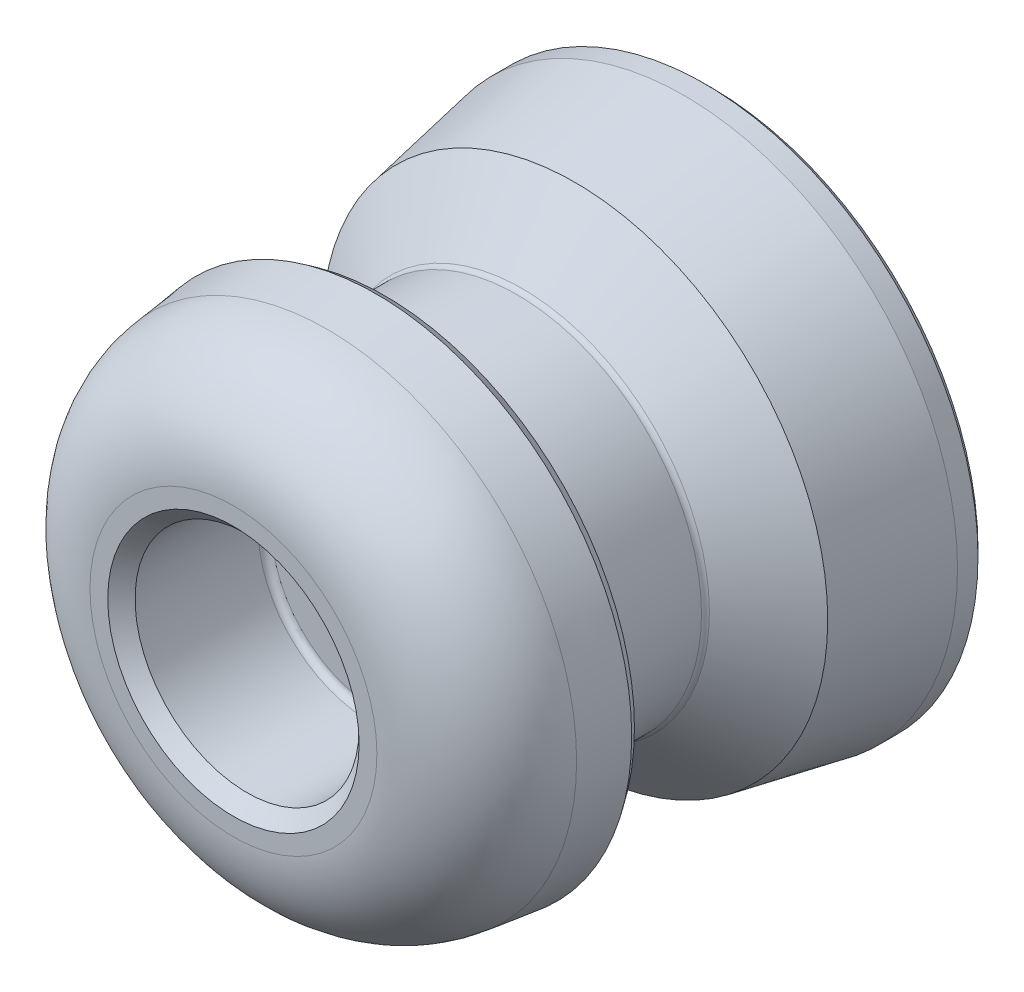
ISO-10303-21;
HEADER;
FILE_DESCRIPTION(('STEP AP214'),'2;1');
FILE_NAME('part.step','',(''),(''),'','','');
FILE_SCHEMA(('AUTOMOTIVE_DESIGN { 1 0 10303 214 1 1 1 1 }'));
ENDSEC;
DATA;
#1=APPLICATION_CONTEXT('core data for automotive mechanical design processes');
#2=APPLICATION_PROTOCOL_DEFINITION('international standard','automotive_design',2000,#1);
#3=PRODUCT_CONTEXT('',#1,'mechanical');
#4=PRODUCT('Part','Part','',(#3));
#5=PRODUCT_RELATED_PRODUCT_CATEGORY('part','',(#4));
#6=PRODUCT_DEFINITION_FORMATION('','',#4);
#7=PRODUCT_DEFINITION_CONTEXT('part definition',#1,'design');
#8=PRODUCT_DEFINITION('design','',#6,#7);
#9=PRODUCT_DEFINITION_SHAPE('','',#8);
#10=(LENGTH_UNIT() NAMED_UNIT(*) SI_UNIT(.MILLI.,.METRE.));
#11=(NAMED_UNIT(*) PLANE_ANGLE_UNIT() SI_UNIT($,.RADIAN.));
#12=(NAMED_UNIT(*) SI_UNIT($,.STERADIAN.) SOLID_ANGLE_UNIT());
#13=UNCERTAINTY_MEASURE_WITH_UNIT(LENGTH_MEASURE(1.E-05),#10,'distance_accuracy_value','');
#14=(GEOMETRIC_REPRESENTATION_CONTEXT(3) GLOBAL_UNCERTAINTY_ASSIGNED_CONTEXT((#13)) GLOBAL_UNIT_ASSIGNED_CONTEXT((#10,
#11,#12)) REPRESENTATION_CONTEXT('',''));
#15=CARTESIAN_POINT('',(0.,0.,0.));
#16=DIRECTION('',(0.,0.,1.));
#17=DIRECTION('',(1.,0.,0.));
#18=AXIS2_PLACEMENT_3D('',#15,#16,#17);
#19=CARTESIAN_POINT('',(5.77350269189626,0.,23.));
#20=DIRECTION('',(0.,0.,-1.));
#21=DIRECTION('',(-1.,0.,0.));
#22=AXIS2_PLACEMENT_3D('',#19,#20,#21);
#23=PLANE('',#22);
#24=DIRECTION('',(-0.5,-0.866025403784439,0.));
#25=VECTOR('',#24,1.);
#26=CARTESIAN_POINT('',(-2.88675134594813,5.,23.));
#27=LINE('',#26,#25);
#28=CARTESIAN_POINT('',(-2.88675134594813,5.,23.));
#29=VERTEX_POINT('',#28);
#30=CARTESIAN_POINT('',(-4.3301270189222,2.5,23.));
#31=VERTEX_POINT('',#30);
#32=EDGE_CURVE('E131',#29,#31,#27,.T.);
#33=ORIENTED_EDGE('',*,*,#32,.T.);
#34=CARTESIAN_POINT('',(0.,0.,23.));
#35=DIRECTION('',(0.,0.,-1.));
#36=DIRECTION('',(-1.,0.,0.));
#37=AXIS2_PLACEMENT_3D('',#34,#35,#36);
#38=CIRCLE('',#37,5.);
#39=CARTESIAN_POINT('',(0.,5.,23.));
#40=VERTEX_POINT('',#39);
#41=EDGE_CURVE('E51',#31,#40,#38,.T.);
#42=ORIENTED_EDGE('',*,*,#41,.T.);
#43=DIRECTION('',(-1.,0.,0.));
#44=VECTOR('',#43,1.);
#45=CARTESIAN_POINT('',(2.88675134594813,5.,23.));
#46=LINE('',#45,#44);
#47=EDGE_CURVE('E330',#40,#29,#46,.T.);
#48=ORIENTED_EDGE('',*,*,#47,.T.);
#49=EDGE_LOOP('',(#33,#42,#48));
#50=FACE_BOUND('',#49,.T.);
#51=ADVANCED_FACE('F36',(#50),#23,.F.);
#52=CARTESIAN_POINT('',(2.88675134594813,5.,23.));
#53=VERTEX_POINT('',#52);
#54=EDGE_CURVE('E334',#53,#40,#46,.T.);
#55=ORIENTED_EDGE('',*,*,#54,.T.);
#56=CARTESIAN_POINT('',(4.33012701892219,2.5,23.));
#57=VERTEX_POINT('',#56);
#58=EDGE_CURVE('E326',#40,#57,#38,.T.);
#59=ORIENTED_EDGE('',*,*,#58,.T.);
#60=DIRECTION('',(-0.5,0.866025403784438,0.));
#61=VECTOR('',#60,1.);
#62=CARTESIAN_POINT('',(5.77350269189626,0.,23.));
#63=LINE('',#62,#61);
#64=EDGE_CURVE('E335',#57,#53,#63,.T.);
#65=ORIENTED_EDGE('',*,*,#64,.T.);
#66=EDGE_LOOP('',(#55,#59,#65));
#67=FACE_BOUND('',#66,.T.);
#68=ADVANCED_FACE('F275',(#67),#23,.F.);
#69=CARTESIAN_POINT('',(5.77350269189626,0.,23.));
#70=VERTEX_POINT('',#69);
#71=EDGE_CURVE('E323',#70,#57,#63,.T.);
#72=ORIENTED_EDGE('',*,*,#71,.T.);
#73=CARTESIAN_POINT('',(4.33012701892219,-2.5,23.));
#74=VERTEX_POINT('',#73);
#75=EDGE_CURVE('E324',#57,#74,#38,.T.);
#76=ORIENTED_EDGE('',*,*,#75,.T.);
#77=DIRECTION('',(0.5,0.866025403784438,0.));
#78=VECTOR('',#77,1.);
#79=CARTESIAN_POINT('',(2.88675134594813,-5.,23.));
#80=LINE('',#79,#78);
#81=EDGE_CURVE('E141',#74,#70,#80,.T.);
#82=ORIENTED_EDGE('',*,*,#81,.T.);
#83=EDGE_LOOP('',(#72,#76,#82));
#84=FACE_BOUND('',#83,.T.);
#85=ADVANCED_FACE('F281',(#84),#23,.F.);
#86=CARTESIAN_POINT('',(2.88675134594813,-5.,23.));
#87=VERTEX_POINT('',#86);
#88=EDGE_CURVE('E142',#87,#74,#80,.T.);
#89=ORIENTED_EDGE('',*,*,#88,.T.);
#90=CARTESIAN_POINT('',(0.,-5.,23.));
#91=VERTEX_POINT('',#90);
#92=EDGE_CURVE('E123',#74,#91,#38,.T.);
#93=ORIENTED_EDGE('',*,*,#92,.T.);
#94=DIRECTION('',(1.,0.,0.));
#95=VECTOR('',#94,1.);
#96=CARTESIAN_POINT('',(-2.88675134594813,-5.,23.));
#97=LINE('',#96,#95);
#98=EDGE_CURVE('E136',#91,#87,#97,.T.);
#99=ORIENTED_EDGE('',*,*,#98,.T.);
#100=EDGE_LOOP('',(#89,#93,#99));
#101=FACE_BOUND('',#100,.T.);
#102=ADVANCED_FACE('F299',(#101),#23,.F.);
#103=CARTESIAN_POINT('',(-2.88675134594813,-5.,23.));
#104=VERTEX_POINT('',#103);
#105=EDGE_CURVE('E122',#104,#91,#97,.T.);
#106=ORIENTED_EDGE('',*,*,#105,.T.);
#107=CARTESIAN_POINT('',(-4.33012701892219,-2.5,23.));
#108=VERTEX_POINT('',#107);
#109=EDGE_CURVE('E109',#91,#108,#38,.T.);
#110=ORIENTED_EDGE('',*,*,#109,.T.);
#111=DIRECTION('',(0.5,-0.866025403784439,0.));
#112=VECTOR('',#111,1.);
#113=CARTESIAN_POINT('',(-5.77350269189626,0.,23.));
#114=LINE('',#113,#112);
#115=EDGE_CURVE('E119',#108,#104,#114,.T.);
#116=ORIENTED_EDGE('',*,*,#115,.T.);
#117=EDGE_LOOP('',(#106,#110,#116));
#118=FACE_BOUND('',#117,.T.);
#119=ADVANCED_FACE('F118',(#118),#23,.F.);
#120=CARTESIAN_POINT('',(0.,0.,0.));
#121=DIRECTION('',(0.,0.,-1.));
#122=DIRECTION('',(-1.,0.,0.));
#123=AXIS2_PLACEMENT_3D('',#120,#121,#122);
#124=PLANE('',#123);
#125=CARTESIAN_POINT('',(0.,0.,0.));
#126=DIRECTION('',(0.,0.,-1.));
#127=DIRECTION('',(-1.,0.,0.));
#128=AXIS2_PLACEMENT_3D('',#125,#126,#127);
#129=CIRCLE('',#128,12.);
#130=CARTESIAN_POINT('',(-12.,0.,0.));
#131=VERTEX_POINT('',#130);
#132=EDGE_CURVE('E211',#131,#131,#129,.T.);
#133=ORIENTED_EDGE('',*,*,#132,.T.);
#134=EDGE_LOOP('',(#133));
#135=FACE_BOUND('',#134,.T.);
#136=CARTESIAN_POINT('',(0.,0.,0.));
#137=DIRECTION('',(0.,0.,-1.));
#138=DIRECTION('',(-1.,0.,0.));
#139=AXIS2_PLACEMENT_3D('',#136,#137,#138);
#140=CIRCLE('',#139,7.);
#141=CARTESIAN_POINT('',(-7.,0.,0.));
#142=VERTEX_POINT('',#141);
#143=EDGE_CURVE('E190',#142,#142,#140,.F.);
#144=ORIENTED_EDGE('',*,*,#143,.T.);
#145=EDGE_LOOP('',(#144));
#146=FACE_BOUND('',#145,.T.);
#147=ADVANCED_FACE('F298',(#135,#146),#124,.T.);
#148=CARTESIAN_POINT('',(0.,0.,115.085006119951));
#149=DIRECTION('',(0.,0.,1.));
#150=DIRECTION('',(1.,0.,0.));
#151=AXIS2_PLACEMENT_3D('',#148,#149,#150);
#152=CYLINDRICAL_SURFACE('',#151,12.5);
#153=CARTESIAN_POINT('',(0.,0.,0.500000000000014));
#154=DIRECTION('',(0.,0.,-1.));
#155=DIRECTION('',(-1.,0.,0.));
#156=AXIS2_PLACEMENT_3D('',#153,#154,#155);
#157=CIRCLE('',#156,12.5);
#158=CARTESIAN_POINT('',(-12.5,0.,0.500000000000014));
#159=VERTEX_POINT('',#158);
#160=EDGE_CURVE('E208',#159,#159,#157,.F.);
#161=ORIENTED_EDGE('',*,*,#160,.T.);
#162=EDGE_LOOP('',(#161));
#163=FACE_BOUND('',#162,.T.);
#164=CARTESIAN_POINT('',(0.,0.,5.));
#165=DIRECTION('',(0.,0.,1.));
#166=DIRECTION('',(1.,0.,0.));
#167=AXIS2_PLACEMENT_3D('',#164,#165,#166);
#168=CIRCLE('',#167,12.5);
#169=CARTESIAN_POINT('',(12.5,0.,5.));
#170=VERTEX_POINT('',#169);
#171=EDGE_CURVE('E170',#170,#170,#168,.T.);
#172=ORIENTED_EDGE('',*,*,#171,.F.);
#173=EDGE_LOOP('',(#172));
#174=FACE_BOUND('',#173,.T.);
#175=ADVANCED_FACE('F304',(#163,#174),#152,.T.);
#176=CARTESIAN_POINT('',(12.5,0.,5.));
#177=DIRECTION('',(0.,0.,-1.));
#178=DIRECTION('',(-1.,0.,0.));
#179=AXIS2_PLACEMENT_3D('',#176,#177,#178);
#180=PLANE('',#179);
#181=CARTESIAN_POINT('',(0.,0.,5.));
#182=DIRECTION('',(0.,0.,-1.));
#183=DIRECTION('',(-1.,0.,0.));
#184=AXIS2_PLACEMENT_3D('',#181,#182,#183);
#185=CIRCLE('',#184,19.5);
#186=CARTESIAN_POINT('',(-19.5,0.,5.));
#187=VERTEX_POINT('',#186);
#188=EDGE_CURVE('E205',#187,#187,#185,.T.);
#189=ORIENTED_EDGE('',*,*,#188,.T.);
#190=EDGE_LOOP('',(#189));
#191=FACE_BOUND('',#190,.T.);
#192=ORIENTED_EDGE('',*,*,#171,.T.);
#193=EDGE_LOOP('',(#192));
#194=FACE_BOUND('',#193,.T.);
#195=ADVANCED_FACE('F386',(#191,#194),#180,.T.);
#196=CARTESIAN_POINT('',(0.,0.,115.085006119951));
#197=DIRECTION('',(0.,0.,1.));
#198=DIRECTION('',(1.,0.,0.));
#199=AXIS2_PLACEMENT_3D('',#196,#197,#198);
#200=CYLINDRICAL_SURFACE('',#199,20.);
#201=CARTESIAN_POINT('',(0.,0.,5.49999999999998));
#202=DIRECTION('',(0.,0.,-1.));
#203=DIRECTION('',(-1.,0.,0.));
#204=AXIS2_PLACEMENT_3D('',#201,#202,#203);
#205=CIRCLE('',#204,20.);
#206=CARTESIAN_POINT('',(-20.,0.,5.49999999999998));
#207=VERTEX_POINT('',#206);
#208=EDGE_CURVE('E202',#207,#207,#205,.F.);
#209=ORIENTED_EDGE('',*,*,#208,.T.);
#210=EDGE_LOOP('',(#209));
#211=FACE_BOUND('',#210,.T.);
#212=CARTESIAN_POINT('',(0.,0.,7.00000000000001));
#213=DIRECTION('',(0.,0.,1.));
#214=DIRECTION('',(1.,0.,0.));
#215=AXIS2_PLACEMENT_3D('',#212,#213,#214);
#216=CIRCLE('',#215,20.);
#217=CARTESIAN_POINT('',(20.,0.,7.00000000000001));
#218=VERTEX_POINT('',#217);
#219=EDGE_CURVE('E167',#218,#218,#216,.T.);
#220=ORIENTED_EDGE('',*,*,#219,.F.);
#221=EDGE_LOOP('',(#220));
#222=FACE_BOUND('',#221,.T.);
#223=ADVANCED_FACE('F390',(#211,#222),#200,.T.);
#224=CARTESIAN_POINT('',(0.,0.,15.));
#225=DIRECTION('',(0.,0.,-1.));
#226=DIRECTION('',(-1.,0.,0.));
#227=AXIS2_PLACEMENT_3D('',#224,#225,#226);
#228=CONICAL_SURFACE('',#227,18.5,0.185347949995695);
#229=ORIENTED_EDGE('',*,*,#219,.T.);
#230=EDGE_LOOP('',(#229));
#231=FACE_BOUND('',#230,.T.);
#232=CARTESIAN_POINT('',(0.,0.,15.));
#233=DIRECTION('',(0.,0.,1.));
#234=DIRECTION('',(1.,0.,0.));
#235=AXIS2_PLACEMENT_3D('',#232,#233,#234);
#236=CIRCLE('',#235,18.5);
#237=CARTESIAN_POINT('',(18.5,0.,15.));
#238=VERTEX_POINT('',#237);
#239=EDGE_CURVE('E164',#238,#238,#236,.T.);
#240=ORIENTED_EDGE('',*,*,#239,.F.);
#241=EDGE_LOOP('',(#240));
#242=FACE_BOUND('',#241,.T.);
#243=ADVANCED_FACE('F394',(#231,#242),#228,.T.);
#244=CARTESIAN_POINT('',(0.,0.,19.));
#245=DIRECTION('',(0.,0.,-1.));
#246=DIRECTION('',(-1.,0.,0.));
#247=AXIS2_PLACEMENT_3D('',#244,#245,#246);
#248=CONICAL_SURFACE('',#247,13.5,0.896055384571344);
#249=CARTESIAN_POINT('',(0.,0.,18.8498780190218));
#250=DIRECTION('',(0.,0.,-1.));
#251=DIRECTION('',(-1.,0.,0.));
#252=AXIS2_PLACEMENT_3D('',#249,#250,#251);
#253=CIRCLE('',#252,13.6876524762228);
#254=CARTESIAN_POINT('',(-13.6876524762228,0.,18.8498780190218));
#255=VERTEX_POINT('',#254);
#256=EDGE_CURVE('E11',#255,#255,#253,.T.);
#257=ORIENTED_EDGE('',*,*,#256,.T.);
#258=EDGE_LOOP('',(#257));
#259=FACE_BOUND('',#258,.T.);
#260=ORIENTED_EDGE('',*,*,#239,.T.);
#261=EDGE_LOOP('',(#260));
#262=FACE_BOUND('',#261,.T.);
#263=ADVANCED_FACE('F398',(#259,#262),#248,.T.);
#264=CARTESIAN_POINT('',(0.,0.,115.085006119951));
#265=DIRECTION('',(0.,0.,1.));
#266=DIRECTION('',(1.,0.,0.));
#267=AXIS2_PLACEMENT_3D('',#264,#265,#266);
#268=CYLINDRICAL_SURFACE('',#267,13.5);
#269=CARTESIAN_POINT('',(0.,0.,27.5862486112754));
#270=DIRECTION('',(0.,0.,1.));
#271=DIRECTION('',(1.,0.,0.));
#272=AXIS2_PLACEMENT_3D('',#269,#270,#271);
#273=CIRCLE('',#272,13.5);
#274=CARTESIAN_POINT('',(13.5,0.,27.5862486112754));
#275=VERTEX_POINT('',#274);
#276=EDGE_CURVE('E44',#275,#275,#273,.F.);
#277=ORIENTED_EDGE('',*,*,#276,.T.);
#278=EDGE_LOOP('',(#277));
#279=FACE_BOUND('',#278,.T.);
#280=CARTESIAN_POINT('',(0.,0.,19.2403124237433));
#281=DIRECTION('',(0.,0.,1.));
#282=DIRECTION('',(1.,0.,0.));
#283=AXIS2_PLACEMENT_3D('',#280,#281,#282);
#284=CIRCLE('',#283,13.5);
#285=CARTESIAN_POINT('',(13.5,0.,19.2403124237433));
#286=VERTEX_POINT('',#285);
#287=EDGE_CURVE('E223',#286,#286,#284,.T.);
#288=ORIENTED_EDGE('',*,*,#287,.T.);
#289=EDGE_LOOP('',(#288));
#290=FACE_BOUND('',#289,.T.);
#291=ADVANCED_FACE('F228',(#279,#290),#268,.T.);
#292=CARTESIAN_POINT('',(0.,0.,29.));
#293=DIRECTION('',(0.,0.,1.));
#294=DIRECTION('',(1.,0.,0.));
#295=AXIS2_PLACEMENT_3D('',#292,#293,#294);
#296=CONICAL_SURFACE('',#295,18.75,1.38257482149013);
#297=CARTESIAN_POINT('',(0.,0.,28.0774178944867));
#298=DIRECTION('',(0.,0.,1.));
#299=DIRECTION('',(1.,0.,0.));
#300=AXIS2_PLACEMENT_3D('',#297,#298,#299);
#301=CIRCLE('',#300,13.906443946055);
#302=CARTESIAN_POINT('',(13.906443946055,0.,28.0774178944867));
#303=VERTEX_POINT('',#302);
#304=EDGE_CURVE('E220',#303,#303,#301,.T.);
#305=ORIENTED_EDGE('',*,*,#304,.T.);
#306=EDGE_LOOP('',(#305));
#307=FACE_BOUND('',#306,.T.);
#308=CARTESIAN_POINT('',(0.,0.,28.906443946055));
#309=DIRECTION('',(0.,0.,-1.));
#310=DIRECTION('',(-1.,0.,0.));
#311=AXIS2_PLACEMENT_3D('',#308,#309,#310);
#312=CIRCLE('',#311,18.2588307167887);
#313=CARTESIAN_POINT('',(-18.2588307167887,0.,28.906443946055));
#314=VERTEX_POINT('',#313);
#315=EDGE_CURVE('E199',#314,#314,#312,.T.);
#316=ORIENTED_EDGE('',*,*,#315,.T.);
#317=EDGE_LOOP('',(#316));
#318=FACE_BOUND('',#317,.T.);
#319=ADVANCED_FACE('F237',(#307,#318),#296,.T.);
#320=CARTESIAN_POINT('',(0.,0.,33.1313902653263));
#321=DIRECTION('',(0.,0.,-1.));
#322=DIRECTION('',(-1.,0.,0.));
#323=AXIS2_PLACEMENT_3D('',#320,#321,#322);
#324=CONICAL_SURFACE('',#323,18.25,0.120438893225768);
#325=CARTESIAN_POINT('',(0.,0.,29.5337553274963));
#326=DIRECTION('',(0.,0.,1.));
#327=DIRECTION('',(1.,0.,0.));
#328=AXIS2_PLACEMENT_3D('',#325,#326,#327);
#329=CIRCLE('',#328,18.6854024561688);
#330=CARTESIAN_POINT('',(18.6854024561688,0.,29.5337553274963));
#331=VERTEX_POINT('',#330);
#332=EDGE_CURVE('E196',#331,#331,#329,.T.);
#333=ORIENTED_EDGE('',*,*,#332,.T.);
#334=EDGE_LOOP('',(#333));
#335=FACE_BOUND('',#334,.T.);
#336=CARTESIAN_POINT('',(0.,0.,33.1313902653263));
#337=DIRECTION('',(0.,0.,1.));
#338=DIRECTION('',(1.,0.,0.));
#339=AXIS2_PLACEMENT_3D('',#336,#337,#338);
#340=CIRCLE('',#339,18.25);
#341=CARTESIAN_POINT('',(18.25,0.,33.1313902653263));
#342=VERTEX_POINT('',#341);
#343=EDGE_CURVE('E161',#342,#342,#340,.T.);
#344=ORIENTED_EDGE('',*,*,#343,.F.);
#345=EDGE_LOOP('',(#344));
#346=FACE_BOUND('',#345,.T.);
#347=ADVANCED_FACE('F240',(#335,#346),#324,.T.);
#348=CARTESIAN_POINT('',(0.,0.,32.1934493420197));
#349=DIRECTION('',(0.,0.,1.));
#350=DIRECTION('',(1.,0.,0.));
#351=AXIS2_PLACEMENT_3D('',#348,#349,#350);
#352=TOROIDAL_SURFACE('',#351,10.5,7.80655065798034);
#353=ORIENTED_EDGE('',*,*,#343,.T.);
#354=EDGE_LOOP('',(#353));
#355=FACE_BOUND('',#354,.T.);
#356=CARTESIAN_POINT('',(0.,0.,40.));
#357=DIRECTION('',(0.,0.,1.));
#358=DIRECTION('',(1.,0.,0.));
#359=AXIS2_PLACEMENT_3D('',#356,#357,#358);
#360=CIRCLE('',#359,10.5);
#361=CARTESIAN_POINT('',(10.5,0.,40.));
#362=VERTEX_POINT('',#361);
#363=EDGE_CURVE('E148',#362,#362,#360,.T.);
#364=ORIENTED_EDGE('',*,*,#363,.F.);
#365=EDGE_LOOP('',(#364));
#366=FACE_BOUND('',#365,.T.);
#367=ADVANCED_FACE('F254',(#355,#366),#352,.T.);
#368=CARTESIAN_POINT('',(10.5,0.,40.));
#369=DIRECTION('',(0.,0.,1.));
#370=DIRECTION('',(1.,0.,0.));
#371=AXIS2_PLACEMENT_3D('',#368,#369,#370);
#372=PLANE('',#371);
#373=CARTESIAN_POINT('',(0.,0.,40.));
#374=DIRECTION('',(0.,0.,1.));
#375=DIRECTION('',(1.,0.,0.));
#376=AXIS2_PLACEMENT_3D('',#373,#374,#375);
#377=CIRCLE('',#376,9.20000000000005);
#378=CARTESIAN_POINT('',(9.20000000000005,0.,40.));
#379=VERTEX_POINT('',#378);
#380=EDGE_CURVE('E187',#379,#379,#377,.F.);
#381=ORIENTED_EDGE('',*,*,#380,.T.);
#382=EDGE_LOOP('',(#381));
#383=FACE_BOUND('',#382,.T.);
#384=ORIENTED_EDGE('',*,*,#363,.T.);
#385=EDGE_LOOP('',(#384));
#386=FACE_BOUND('',#385,.T.);
#387=ADVANCED_FACE('F260',(#383,#386),#372,.T.);
#388=CARTESIAN_POINT('',(0.,0.,29.5));
#389=DIRECTION('',(0.,0.,1.));
#390=DIRECTION('',(1.,0.,0.));
#391=AXIS2_PLACEMENT_3D('',#388,#389,#390);
#392=CYLINDRICAL_SURFACE('',#391,8.2);
#393=CARTESIAN_POINT('',(0.,0.,30.));
#394=DIRECTION('',(0.,0.,1.));
#395=DIRECTION('',(1.,0.,0.));
#396=AXIS2_PLACEMENT_3D('',#393,#394,#395);
#397=CIRCLE('',#396,8.2);
#398=CARTESIAN_POINT('',(8.2,0.,30.));
#399=VERTEX_POINT('',#398);
#400=EDGE_CURVE('E217',#399,#399,#397,.F.);
#401=CARTESIAN_POINT('',(0.,0.,39.));
#402=DIRECTION('',(0.,0.,1.));
#403=DIRECTION('',(1.,0.,0.));
#404=AXIS2_PLACEMENT_3D('',#401,#402,#403);
#405=CIRCLE('',#404,8.2);
#406=CARTESIAN_POINT('',(8.2,0.,39.));
#407=VERTEX_POINT('',#406);
#408=EDGE_CURVE('E184',#407,#407,#405,.T.);
#409=CARTESIAN_POINT('',(8.2,0.,30.));
#410=CARTESIAN_POINT('',(8.2,0.,30.09375));
#411=CARTESIAN_POINT('',(8.2,0.,30.1875));
#412=CARTESIAN_POINT('',(8.2,0.,30.375));
#413=CARTESIAN_POINT('',(8.2,0.,30.46875));
#414=CARTESIAN_POINT('',(8.2,0.,30.65625));
#415=CARTESIAN_POINT('',(8.2,0.,30.75));
#416=CARTESIAN_POINT('',(8.2,0.,30.9375));
#417=CARTESIAN_POINT('',(8.2,0.,31.03125));
#418=CARTESIAN_POINT('',(8.2,0.,31.21875));
#419=CARTESIAN_POINT('',(8.2,0.,31.3125));
#420=CARTESIAN_POINT('',(8.2,0.,31.5));
#421=CARTESIAN_POINT('',(8.2,0.,31.59375));
#422=CARTESIAN_POINT('',(8.2,0.,31.78125));
#423=CARTESIAN_POINT('',(8.2,0.,31.875));
#424=CARTESIAN_POINT('',(8.2,0.,32.0625));
#425=CARTESIAN_POINT('',(8.2,0.,32.15625));
#426=CARTESIAN_POINT('',(8.2,0.,32.34375));
#427=CARTESIAN_POINT('',(8.2,0.,32.4375));
#428=CARTESIAN_POINT('',(8.2,0.,32.625));
#429=CARTESIAN_POINT('',(8.2,0.,32.71875));
#430=CARTESIAN_POINT('',(8.2,0.,32.90625));
#431=CARTESIAN_POINT('',(8.2,0.,33.));
#432=CARTESIAN_POINT('',(8.2,0.,33.1875));
#433=CARTESIAN_POINT('',(8.2,0.,33.28125));
#434=CARTESIAN_POINT('',(8.2,0.,33.46875));
#435=CARTESIAN_POINT('',(8.2,0.,33.5625));
#436=CARTESIAN_POINT('',(8.2,0.,33.75));
#437=CARTESIAN_POINT('',(8.2,0.,33.84375));
#438=CARTESIAN_POINT('',(8.2,0.,34.03125));
#439=CARTESIAN_POINT('',(8.2,0.,34.125));
#440=CARTESIAN_POINT('',(8.2,0.,34.3125));
#441=CARTESIAN_POINT('',(8.2,0.,34.40625));
#442=CARTESIAN_POINT('',(8.2,0.,34.59375));
#443=CARTESIAN_POINT('',(8.2,0.,34.6875));
#444=CARTESIAN_POINT('',(8.2,0.,34.875));
#445=CARTESIAN_POINT('',(8.2,0.,34.96875));
#446=CARTESIAN_POINT('',(8.2,0.,35.15625));
#447=CARTESIAN_POINT('',(8.2,0.,35.25));
#448=CARTESIAN_POINT('',(8.2,0.,35.4375));
#449=CARTESIAN_POINT('',(8.2,0.,35.53125));
#450=CARTESIAN_POINT('',(8.2,0.,35.71875));
#451=CARTESIAN_POINT('',(8.2,0.,35.8125));
#452=CARTESIAN_POINT('',(8.2,0.,36.));
#453=CARTESIAN_POINT('',(8.2,0.,36.09375));
#454=CARTESIAN_POINT('',(8.2,0.,36.28125));
#455=CARTESIAN_POINT('',(8.2,0.,36.375));
#456=CARTESIAN_POINT('',(8.2,0.,36.5625));
#457=CARTESIAN_POINT('',(8.2,0.,36.65625));
#458=CARTESIAN_POINT('',(8.2,0.,36.84375));
#459=CARTESIAN_POINT('',(8.2,0.,36.9375));
#460=CARTESIAN_POINT('',(8.2,0.,37.125));
#461=CARTESIAN_POINT('',(8.2,0.,37.21875));
#462=CARTESIAN_POINT('',(8.2,0.,37.40625));
#463=CARTESIAN_POINT('',(8.2,0.,37.5));
#464=CARTESIAN_POINT('',(8.2,0.,37.6875));
#465=CARTESIAN_POINT('',(8.2,0.,37.78125));
#466=CARTESIAN_POINT('',(8.2,0.,37.96875));
#467=CARTESIAN_POINT('',(8.2,0.,38.0625));
#468=CARTESIAN_POINT('',(8.2,0.,38.25));
#469=CARTESIAN_POINT('',(8.2,0.,38.34375));
#470=CARTESIAN_POINT('',(8.2,0.,38.53125));
#471=CARTESIAN_POINT('',(8.2,0.,38.625));
#472=CARTESIAN_POINT('',(8.2,0.,38.8125));
#473=CARTESIAN_POINT('',(8.2,0.,38.90625));
#474=CARTESIAN_POINT('',(8.2,0.,39.));
#475=B_SPLINE_CURVE_WITH_KNOTS('',3,(#409,#410,#411,#412,#413,#414,#415,#416,#417,#418,#419,
#420,#421,#422,#423,#424,#425,#426,#427,#428,#429,#430,#431,#432,#433,#434,#435,#436,#437,#438,
#439,#440,#441,#442,#443,#444,#445,#446,#447,#448,#449,#450,#451,#452,#453,#454,#455,#456,#457,
#458,#459,#460,#461,#462,#463,#464,#465,#466,#467,#468,#469,#470,#471,#472,#473,#474),
.UNSPECIFIED.,.F.,.F.,(4,2,2,2,2,2,2,2,2,2,2,2,2,2,2,2,2,2,2,2,2,2,2,2,2,2,2,2,2,2,2,2,4),(0.,
0.28125,0.562499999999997,0.843749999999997,1.125,1.40624999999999,1.68749999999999,
1.96874999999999,2.24999999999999,2.53124999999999,2.81249999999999,3.09374999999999,
3.37499999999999,3.65624999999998,3.93749999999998,4.21874999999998,4.49999999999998,
4.78124999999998,5.06249999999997,5.34374999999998,5.62499999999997,5.90624999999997,
6.18749999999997,6.46874999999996,6.74999999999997,7.03124999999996,7.31249999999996,
7.59374999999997,7.87499999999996,8.15624999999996,8.43749999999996,8.71874999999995,
8.99999999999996),.UNSPECIFIED.);
#476=EDGE_CURVE('BSEAM265',#399,#407,#475,.T.);
#477=ORIENTED_EDGE('',*,*,#400,.T.);
#478=ORIENTED_EDGE('',*,*,#408,.T.);
#479=ORIENTED_EDGE('',*,*,#476,.T.);
#480=ORIENTED_EDGE('',*,*,#476,.F.);
#481=EDGE_LOOP('',(#477,#479,#478,#480));
#482=FACE_BOUND('',#481,.T.);
#483=ADVANCED_FACE('F265',(#482),#392,.F.);
#484=CARTESIAN_POINT('',(0.,0.,29.5));
#485=DIRECTION('',(0.,0.,1.));
#486=DIRECTION('',(1.,0.,0.));
#487=AXIS2_PLACEMENT_3D('',#484,#485,#486);
#488=PLANE('',#487);
#489=CARTESIAN_POINT('',(0.,0.,29.5));
#490=DIRECTION('',(0.,0.,1.));
#491=DIRECTION('',(1.,0.,0.));
#492=AXIS2_PLACEMENT_3D('',#489,#490,#491);
#493=CIRCLE('',#492,7.7);
#494=CARTESIAN_POINT('',(7.7,0.,29.5));
#495=VERTEX_POINT('',#494);
#496=EDGE_CURVE('E214',#495,#495,#493,.T.);
#497=ORIENTED_EDGE('',*,*,#496,.T.);
#498=EDGE_LOOP('',(#497));
#499=FACE_BOUND('',#498,.T.);
#500=DIRECTION('',(-0.5,0.866025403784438,0.));
#501=VECTOR('',#500,1.);
#502=CARTESIAN_POINT('',(4.33012701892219,2.5,29.5));
#503=LINE('',#502,#501);
#504=CARTESIAN_POINT('',(5.77350269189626,0.,29.5));
#505=VERTEX_POINT('',#504);
#506=CARTESIAN_POINT('',(2.88675134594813,5.,29.5));
#507=VERTEX_POINT('',#506);
#508=EDGE_CURVE('E59',#505,#507,#503,.T.);
#509=ORIENTED_EDGE('',*,*,#508,.F.);
#510=DIRECTION('',(0.5,0.866025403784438,0.));
#511=VECTOR('',#510,1.);
#512=CARTESIAN_POINT('',(4.33012701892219,-2.5,29.5));
#513=LINE('',#512,#511);
#514=CARTESIAN_POINT('',(2.88675134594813,-5.,29.5));
#515=VERTEX_POINT('',#514);
#516=EDGE_CURVE('E181',#515,#505,#513,.T.);
#517=ORIENTED_EDGE('',*,*,#516,.F.);
#518=DIRECTION('',(1.,0.,0.));
#519=VECTOR('',#518,1.);
#520=CARTESIAN_POINT('',(0.,-5.,29.5));
#521=LINE('',#520,#519);
#522=CARTESIAN_POINT('',(-2.88675134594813,-5.,29.5));
#523=VERTEX_POINT('',#522);
#524=EDGE_CURVE('E179',#523,#515,#521,.T.);
#525=ORIENTED_EDGE('',*,*,#524,.F.);
#526=DIRECTION('',(0.5,-0.866025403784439,0.));
#527=VECTOR('',#526,1.);
#528=CARTESIAN_POINT('',(-4.33012701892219,-2.5,29.5));
#529=LINE('',#528,#527);
#530=CARTESIAN_POINT('',(-5.77350269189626,0.,29.5));
#531=VERTEX_POINT('',#530);
#532=EDGE_CURVE('E177',#531,#523,#529,.T.);
#533=ORIENTED_EDGE('',*,*,#532,.F.);
#534=DIRECTION('',(-0.5,-0.866025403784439,0.));
#535=VECTOR('',#534,1.);
#536=CARTESIAN_POINT('',(-4.33012701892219,2.5,29.5));
#537=LINE('',#536,#535);
#538=CARTESIAN_POINT('',(-2.88675134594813,5.,29.5));
#539=VERTEX_POINT('',#538);
#540=EDGE_CURVE('E175',#539,#531,#537,.T.);
#541=ORIENTED_EDGE('',*,*,#540,.F.);
#542=DIRECTION('',(-1.,0.,0.));
#543=VECTOR('',#542,1.);
#544=CARTESIAN_POINT('',(0.,5.,29.5));
#545=LINE('',#544,#543);
#546=EDGE_CURVE('E173',#507,#539,#545,.T.);
#547=ORIENTED_EDGE('',*,*,#546,.F.);
#548=EDGE_LOOP('',(#509,#517,#525,#533,#541,#547));
#549=FACE_BOUND('',#548,.T.);
#550=ADVANCED_FACE('F271',(#499,#549),#488,.T.);
#551=CARTESIAN_POINT('',(5.77350269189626,0.,23.));
#552=DIRECTION('',(0.866025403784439,0.5,0.));
#553=DIRECTION('',(-0.5,0.866025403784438,0.));
#554=AXIS2_PLACEMENT_3D('',#551,#552,#553);
#555=PLANE('',#554);
#556=ORIENTED_EDGE('',*,*,#64,.F.);
#557=ORIENTED_EDGE('',*,*,#71,.F.);
#558=DIRECTION('',(0.,0.,1.));
#559=VECTOR('',#558,1.);
#560=CARTESIAN_POINT('',(5.77350269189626,0.,23.));
#561=LINE('',#560,#559);
#562=EDGE_CURVE('E146',#70,#505,#561,.T.);
#563=ORIENTED_EDGE('',*,*,#562,.T.);
#564=ORIENTED_EDGE('',*,*,#508,.T.);
#565=DIRECTION('',(0.,0.,1.));
#566=VECTOR('',#565,1.);
#567=CARTESIAN_POINT('',(2.88675134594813,5.,23.));
#568=LINE('',#567,#566);
#569=EDGE_CURVE('E145',#53,#507,#568,.T.);
#570=ORIENTED_EDGE('',*,*,#569,.F.);
#571=EDGE_LOOP('',(#556,#557,#563,#564,#570));
#572=FACE_BOUND('',#571,.T.);
#573=ADVANCED_FACE('F337',(#572),#555,.F.);
#574=CARTESIAN_POINT('',(2.88675134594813,-5.,23.));
#575=DIRECTION('',(0.866025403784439,-0.5,0.));
#576=DIRECTION('',(0.5,0.866025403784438,0.));
#577=AXIS2_PLACEMENT_3D('',#574,#575,#576);
#578=PLANE('',#577);
#579=ORIENTED_EDGE('',*,*,#81,.F.);
#580=ORIENTED_EDGE('',*,*,#88,.F.);
#581=DIRECTION('',(0.,0.,1.));
#582=VECTOR('',#581,1.);
#583=CARTESIAN_POINT('',(2.88675134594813,-5.,23.));
#584=LINE('',#583,#582);
#585=EDGE_CURVE('E149',#87,#515,#584,.T.);
#586=ORIENTED_EDGE('',*,*,#585,.T.);
#587=ORIENTED_EDGE('',*,*,#516,.T.);
#588=ORIENTED_EDGE('',*,*,#562,.F.);
#589=EDGE_LOOP('',(#579,#580,#586,#587,#588));
#590=FACE_BOUND('',#589,.T.);
#591=ADVANCED_FACE('F317',(#590),#578,.F.);
#592=CARTESIAN_POINT('',(-2.88675134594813,-5.,23.));
#593=DIRECTION('',(0.,-1.,0.));
#594=DIRECTION('',(0.,0.,-1.));
#595=AXIS2_PLACEMENT_3D('',#592,#593,#594);
#596=PLANE('',#595);
#597=ORIENTED_EDGE('',*,*,#98,.F.);
#598=ORIENTED_EDGE('',*,*,#105,.F.);
#599=DIRECTION('',(0.,0.,1.));
#600=VECTOR('',#599,1.);
#601=CARTESIAN_POINT('',(-2.88675134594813,-5.,23.));
#602=LINE('',#601,#600);
#603=EDGE_CURVE('E130',#104,#523,#602,.T.);
#604=ORIENTED_EDGE('',*,*,#603,.T.);
#605=ORIENTED_EDGE('',*,*,#524,.T.);
#606=ORIENTED_EDGE('',*,*,#585,.F.);
#607=EDGE_LOOP('',(#597,#598,#604,#605,#606));
#608=FACE_BOUND('',#607,.T.);
#609=ADVANCED_FACE('F345',(#608),#596,.F.);
#610=CARTESIAN_POINT('',(-5.77350269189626,0.,23.));
#611=DIRECTION('',(-0.866025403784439,-0.5,0.));
#612=DIRECTION('',(0.5,-0.866025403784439,0.));
#613=AXIS2_PLACEMENT_3D('',#610,#611,#612);
#614=PLANE('',#613);
#615=ORIENTED_EDGE('',*,*,#115,.F.);
#616=CARTESIAN_POINT('',(-5.77350269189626,0.,23.));
#617=VERTEX_POINT('',#616);
#618=EDGE_CURVE('E128',#617,#108,#114,.T.);
#619=ORIENTED_EDGE('',*,*,#618,.F.);
#620=DIRECTION('',(0.,0.,1.));
#621=VECTOR('',#620,1.);
#622=CARTESIAN_POINT('',(-5.77350269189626,0.,23.));
#623=LINE('',#622,#621);
#624=EDGE_CURVE('E153',#617,#531,#623,.T.);
#625=ORIENTED_EDGE('',*,*,#624,.T.);
#626=ORIENTED_EDGE('',*,*,#532,.T.);
#627=ORIENTED_EDGE('',*,*,#603,.F.);
#628=EDGE_LOOP('',(#615,#619,#625,#626,#627));
#629=FACE_BOUND('',#628,.T.);
#630=ADVANCED_FACE('F126',(#629),#614,.F.);
#631=CARTESIAN_POINT('',(-2.88675134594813,5.,23.));
#632=DIRECTION('',(-0.866025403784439,0.5,0.));
#633=DIRECTION('',(-0.5,-0.866025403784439,0.));
#634=AXIS2_PLACEMENT_3D('',#631,#632,#633);
#635=PLANE('',#634);
#636=EDGE_CURVE('E134',#31,#617,#27,.T.);
#637=ORIENTED_EDGE('',*,*,#636,.F.);
#638=ORIENTED_EDGE('',*,*,#32,.F.);
#639=DIRECTION('',(0.,0.,1.));
#640=VECTOR('',#639,1.);
#641=CARTESIAN_POINT('',(-2.88675134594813,5.,23.));
#642=LINE('',#641,#640);
#643=EDGE_CURVE('E155',#29,#539,#642,.T.);
#644=ORIENTED_EDGE('',*,*,#643,.T.);
#645=ORIENTED_EDGE('',*,*,#540,.T.);
#646=ORIENTED_EDGE('',*,*,#624,.F.);
#647=EDGE_LOOP('',(#637,#638,#644,#645,#646));
#648=FACE_BOUND('',#647,.T.);
#649=ADVANCED_FACE('F294',(#648),#635,.F.);
#650=CARTESIAN_POINT('',(2.88675134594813,5.,23.));
#651=DIRECTION('',(0.,1.,0.));
#652=DIRECTION('',(-1.,0.,0.));
#653=AXIS2_PLACEMENT_3D('',#650,#651,#652);
#654=PLANE('',#653);
#655=ORIENTED_EDGE('',*,*,#47,.F.);
#656=ORIENTED_EDGE('',*,*,#54,.F.);
#657=ORIENTED_EDGE('',*,*,#569,.T.);
#658=ORIENTED_EDGE('',*,*,#546,.T.);
#659=ORIENTED_EDGE('',*,*,#643,.F.);
#660=EDGE_LOOP('',(#655,#656,#657,#658,#659));
#661=FACE_BOUND('',#660,.T.);
#662=ADVANCED_FACE('F287',(#661),#654,.F.);
#663=ORIENTED_EDGE('',*,*,#618,.T.);
#664=EDGE_CURVE('E106',#108,#31,#38,.T.);
#665=ORIENTED_EDGE('',*,*,#664,.T.);
#666=ORIENTED_EDGE('',*,*,#636,.T.);
#667=EDGE_LOOP('',(#663,#665,#666));
#668=FACE_BOUND('',#667,.T.);
#669=ADVANCED_FACE('F133',(#668),#23,.F.);
#670=CARTESIAN_POINT('',(0.,0.,0.));
#671=DIRECTION('',(0.,0.,1.));
#672=DIRECTION('',(1.,0.,0.));
#673=AXIS2_PLACEMENT_3D('',#670,#671,#672);
#674=CYLINDRICAL_SURFACE('',#673,5.);
#675=CARTESIAN_POINT('',(0.,0.,2.00000000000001));
#676=DIRECTION('',(0.,0.,-1.));
#677=DIRECTION('',(-1.,0.,0.));
#678=AXIS2_PLACEMENT_3D('',#675,#676,#677);
#679=CIRCLE('',#678,5.);
#680=CARTESIAN_POINT('',(-5.,0.,2.00000000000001));
#681=VERTEX_POINT('',#680);
#682=EDGE_CURVE('E193',#681,#681,#679,.T.);
#683=ORIENTED_EDGE('',*,*,#682,.T.);
#684=EDGE_LOOP('',(#683));
#685=FACE_BOUND('',#684,.T.);
#686=ORIENTED_EDGE('',*,*,#664,.F.);
#687=ORIENTED_EDGE('',*,*,#109,.F.);
#688=ORIENTED_EDGE('',*,*,#92,.F.);
#689=ORIENTED_EDGE('',*,*,#75,.F.);
#690=ORIENTED_EDGE('',*,*,#58,.F.);
#691=ORIENTED_EDGE('',*,*,#41,.F.);
#692=EDGE_LOOP('',(#686,#687,#688,#689,#690,#691));
#693=FACE_BOUND('',#692,.T.);
#694=ADVANCED_FACE('F108',(#685,#693),#674,.F.);
#695=CARTESIAN_POINT('',(0.,0.,39.));
#696=DIRECTION('',(0.,0.,1.));
#697=DIRECTION('',(1.,0.,0.));
#698=AXIS2_PLACEMENT_3D('',#695,#696,#697);
#699=CONICAL_SURFACE('',#698,8.2,0.785398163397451);
#700=ORIENTED_EDGE('',*,*,#380,.F.);
#701=EDGE_LOOP('',(#700));
#702=FACE_BOUND('',#701,.T.);
#703=ORIENTED_EDGE('',*,*,#408,.F.);
#704=EDGE_LOOP('',(#703));
#705=FACE_BOUND('',#704,.T.);
#706=ADVANCED_FACE('F292',(#702,#705),#699,.F.);
#707=CARTESIAN_POINT('',(0.,0.,0.));
#708=DIRECTION('',(0.,0.,-1.));
#709=DIRECTION('',(-1.,0.,0.));
#710=AXIS2_PLACEMENT_3D('',#707,#708,#709);
#711=CONICAL_SURFACE('',#710,7.,0.785398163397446);
#712=ORIENTED_EDGE('',*,*,#682,.F.);
#713=EDGE_LOOP('',(#712));
#714=FACE_BOUND('',#713,.T.);
#715=ORIENTED_EDGE('',*,*,#143,.F.);
#716=EDGE_LOOP('',(#715));
#717=FACE_BOUND('',#716,.T.);
#718=ADVANCED_FACE('F248',(#714,#717),#711,.F.);
#719=CARTESIAN_POINT('',(0.,0.,29.5337553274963));
#720=DIRECTION('',(0.,0.,1.));
#721=DIRECTION('',(1.,0.,0.));
#722=AXIS2_PLACEMENT_3D('',#719,#720,#721);
#723=CONICAL_SURFACE('',#722,18.6854024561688,0.597176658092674);
#724=ORIENTED_EDGE('',*,*,#315,.F.);
#725=EDGE_LOOP('',(#724));
#726=FACE_BOUND('',#725,.T.);
#727=ORIENTED_EDGE('',*,*,#332,.F.);
#728=EDGE_LOOP('',(#727));
#729=FACE_BOUND('',#728,.T.);
#730=ADVANCED_FACE('F244',(#726,#729),#723,.T.);
#731=CARTESIAN_POINT('',(0.,0.,5.49999999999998));
#732=DIRECTION('',(0.,0.,1.));
#733=DIRECTION('',(1.,0.,0.));
#734=AXIS2_PLACEMENT_3D('',#731,#732,#733);
#735=CONICAL_SURFACE('',#734,20.,0.785398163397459);
#736=ORIENTED_EDGE('',*,*,#188,.F.);
#737=EDGE_LOOP('',(#736));
#738=FACE_BOUND('',#737,.T.);
#739=ORIENTED_EDGE('',*,*,#208,.F.);
#740=EDGE_LOOP('',(#739));
#741=FACE_BOUND('',#740,.T.);
#742=ADVANCED_FACE('F247',(#738,#741),#735,.T.);
#743=CARTESIAN_POINT('',(0.,0.,0.500000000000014));
#744=DIRECTION('',(0.,0.,1.));
#745=DIRECTION('',(1.,0.,0.));
#746=AXIS2_PLACEMENT_3D('',#743,#744,#745);
#747=CONICAL_SURFACE('',#746,12.5,0.785398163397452);
#748=ORIENTED_EDGE('',*,*,#132,.F.);
#749=EDGE_LOOP('',(#748));
#750=FACE_BOUND('',#749,.T.);
#751=ORIENTED_EDGE('',*,*,#160,.F.);
#752=EDGE_LOOP('',(#751));
#753=FACE_BOUND('',#752,.T.);
#754=ADVANCED_FACE('F365',(#750,#753),#747,.T.);
#755=CARTESIAN_POINT('',(0.,0.,30.));
#756=DIRECTION('',(0.,0.,1.));
#757=DIRECTION('',(1.,0.,0.));
#758=AXIS2_PLACEMENT_3D('',#755,#756,#757);
#759=TOROIDAL_SURFACE('',#758,7.7,0.5);
#760=ORIENTED_EDGE('',*,*,#400,.F.);
#761=EDGE_LOOP('',(#760));
#762=FACE_BOUND('',#761,.T.);
#763=ORIENTED_EDGE('',*,*,#496,.F.);
#764=EDGE_LOOP('',(#763));
#765=FACE_BOUND('',#764,.T.);
#766=ADVANCED_FACE('F234',(#762,#765),#759,.F.);
#767=CARTESIAN_POINT('',(0.,0.,27.5862486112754));
#768=DIRECTION('',(0.,0.,1.));
#769=DIRECTION('',(1.,0.,0.));
#770=AXIS2_PLACEMENT_3D('',#767,#768,#769);
#771=TOROIDAL_SURFACE('',#770,14.,0.5);
#772=ORIENTED_EDGE('',*,*,#276,.F.);
#773=EDGE_LOOP('',(#772));
#774=FACE_BOUND('',#773,.T.);
#775=ORIENTED_EDGE('',*,*,#304,.F.);
#776=EDGE_LOOP('',(#775));
#777=FACE_BOUND('',#776,.T.);
#778=ADVANCED_FACE('F231',(#774,#777),#771,.F.);
#779=CARTESIAN_POINT('',(0.,0.,19.2403124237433));
#780=DIRECTION('',(0.,0.,1.));
#781=DIRECTION('',(1.,0.,0.));
#782=AXIS2_PLACEMENT_3D('',#779,#780,#781);
#783=TOROIDAL_SURFACE('',#782,14.,0.5);
#784=ORIENTED_EDGE('',*,*,#256,.F.);
#785=EDGE_LOOP('',(#784));
#786=FACE_BOUND('',#785,.T.);
#787=ORIENTED_EDGE('',*,*,#287,.F.);
#788=EDGE_LOOP('',(#787));
#789=FACE_BOUND('',#788,.T.);
#790=ADVANCED_FACE('F38',(#786,#789),#783,.F.);
#791=CLOSED_SHELL('',(#51,#68,#85,#102,#119,#147,#175,#195,#223,#243,#263,#291,#319,#347,#367,
#387,#483,#550,#573,#591,#609,#630,#649,#662,#669,#694,#706,#718,#730,#742,#754,#766,#778,#790));
#792=MANIFOLD_SOLID_BREP('B2',#791);
#793=ADVANCED_BREP_SHAPE_REPRESENTATION('',(#18,#792),#14);
#794=SHAPE_DEFINITION_REPRESENTATION(#9,#793);
ENDSEC;
END-ISO-10303-21;
